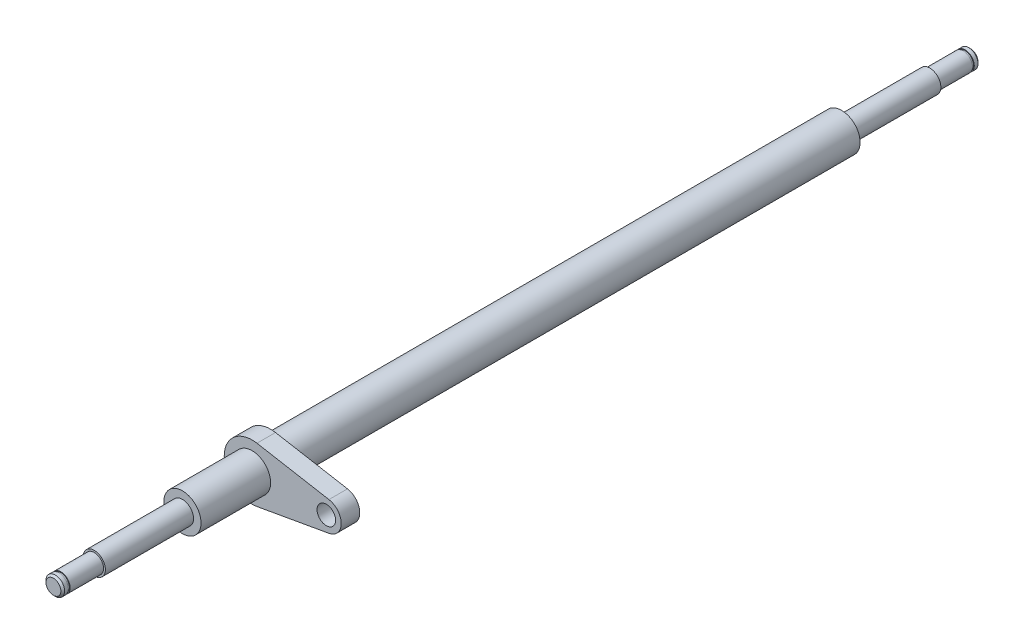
from build123d import *

# Parameters (mm, degrees)
SCHNITT_LINEAR_AUSTRAGEN1_DEPTH = 2.4
SKIZZE3_R                       = 10
AUFSATZ_LINEAR_AUSTRAGEN1_DEPTH = 177.5
AUFSATZ_LINEAR_START            = -42.5
SKIZZE4_R                       = 5
SKIZZE4_R_2                     = 10
AUFSATZ_LINEAR_AUSTRAGEN2_DEPTH = 5


with BuildPart() as part:
    # Skizze1 → Rotation1 (revolve)
    with BuildSketch(Plane(origin=(0, 0, 0), x_dir=(0, 0, -1), z_dir=(1, 0, 0)), mode=Mode.PRIVATE) as rotation1_sk:
        Polygon((0, 0), (0, 6), (-225, 6), (-225, 5), (-243, 5), (-243, 4.6), (-244, 4.6), (-244, 5), (-246, 5), (-247, 4), (-247, 0), align=None)
    revolve(rotation1_sk.sketch.rotate(Axis((0, 0, 0), (0, 0, 1)), 90), axis=Axis((0, 0, 0), (0, 0, 1)))

    # Skizze2 → Schnitt-Linear austragen1 (cut)
    with BuildSketch(Plane(origin=(-5, 0, 0), x_dir=(0, 0, -1), z_dir=(1, 0, 0))):
        with BuildLine():
            Line((-240, 2), (-228, 2))
            ThreePointArc((-228, 2), (-226, 0), (-228, -2))
            Line((-228, -2), (-240, -2))
            ThreePointArc((-240, -2), (-242, 0), (-240, 2))
        make_face()
    extrude(amount=SCHNITT_LINEAR_AUSTRAGEN1_DEPTH, mode=Mode.SUBTRACT)

    # Spiegeln1: part across plane


with BuildPart() as part_1:
    add(part.part)
    add(part.part.mirror(Plane(origin=(0, 0, 0), x_dir=(1, 0, 0), z_dir=(0, 0, -1))))

    # Skizze3 → Aufsatz-Linear austragen1 (add, symmetric)
    with BuildSketch(Plane.XY):
        Circle(SKIZZE3_R)
    extrude(amount=AUFSATZ_LINEAR_AUSTRAGEN1_DEPTH, both=True)


with BuildPart() as body_2:
    # Skizze4 → Aufsatz-Linear austragen2 (new, symmetric)
    with BuildSketch(Plane.XY.offset(177.5).offset(AUFSATZ_LINEAR_START)):
        with BuildLine():
            Line((2.625, -14.768526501), (41.4, -7.876547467))
            ThreePointArc((41.4, -7.876547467), (48, 0), (41.4, 7.876547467))
            Line((41.4, 7.876547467), (2.625, 14.768526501))
            ThreePointArc((2.625, 14.768526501), (-15, 0), (2.625, -14.768526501))
        make_face()
        with Locations((40, 0)):
            Circle(SKIZZE4_R, mode=Mode.SUBTRACT)
        Circle(SKIZZE4_R_2, mode=Mode.SUBTRACT)
    extrude(amount=AUFSATZ_LINEAR_AUSTRAGEN2_DEPTH, both=True)


solid = Compound([part_1.part, body_2.part])
